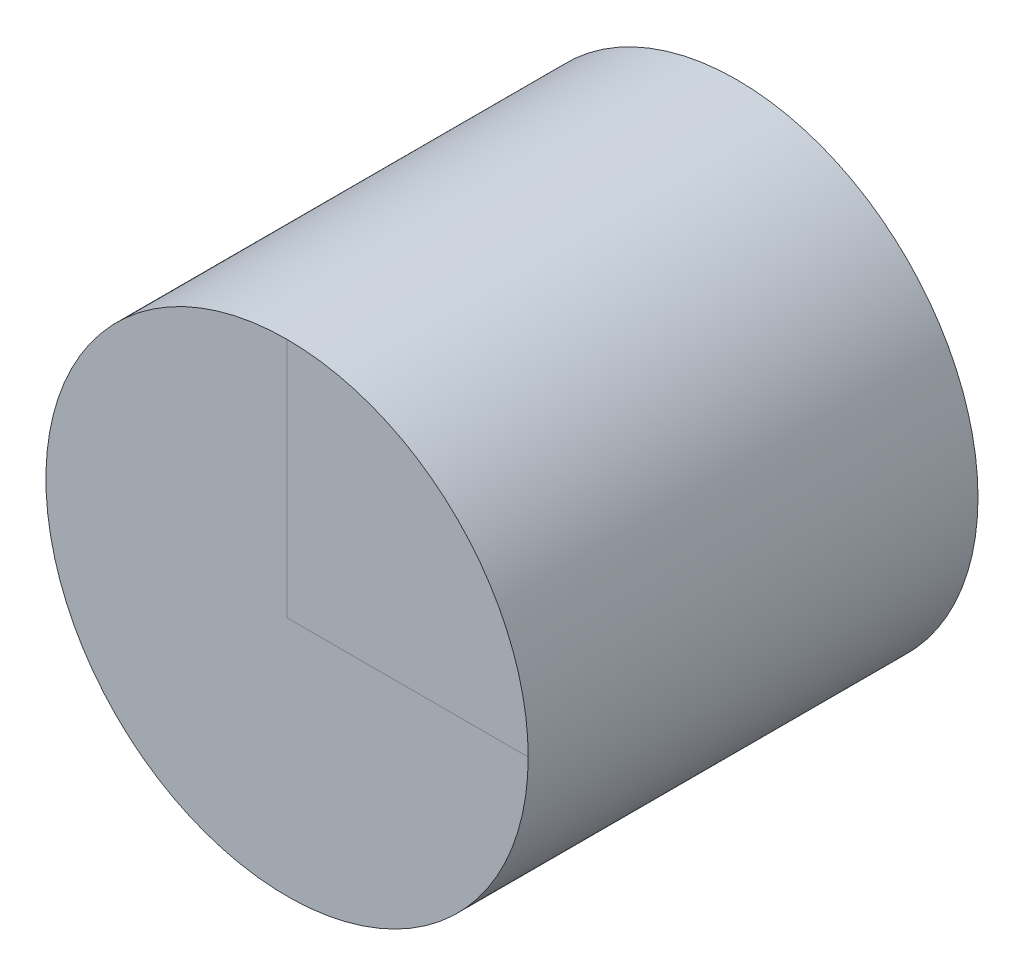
from build123d import *

# Parameters (mm, degrees)
SKETCH1_R      = 60
EXTRUDE1_DEPTH = 111.92


with BuildPart() as part:
    # Sketch1 → Extrude1 (new body)
    with BuildSketch(Plane.XY):
        Circle(SKETCH1_R)
    extrude(amount=EXTRUDE1_DEPTH)


solid = part.part
